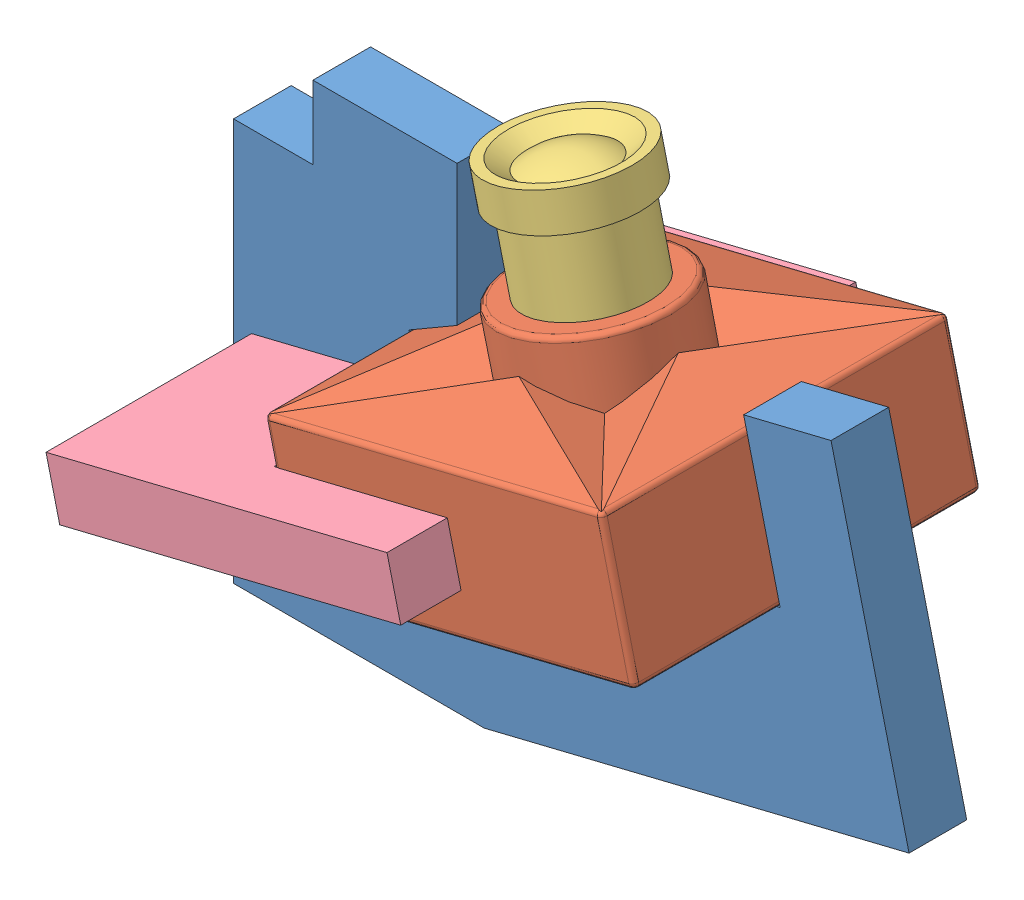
SolidWorks assembly CCD AD1.SLDASM, configuration Default (file format 3100). Lengths in mm.
Overall size (68.45 56.49 47.5).
5 component instances, 4 part files, 5 mates.
Components (placement in the parent):
- CCD camera card AD1-1: CCD camera card AD1.SLDPRT [Default] at (-45.1883 -15.2882 -2.921) size (68.45 48.18 5.84)
- CCD camera-1: CCD camera.SLDASM [Default] at (-15.6733 3.5848 0.0362) x (0.23811 -0.971238 0) z (0 0 1) size (32.86 35.2 35.2)
  - CCD camera base-1: CCD camera base.SLDPRT [Default] at (-14.6184 9.1117 0) size (21.64 35.2 35.2)
  - CCD camera lens-1: CCD camera lens.SLDPRT [Default] at (-28.5037 9.1117 0) x (1 0 0) z (0 0.535089 0.844796) size (20.19 13.97 13.97)
- CCD camera card stabilizer AD1-1: CCD camera card stabilizer AD1.SLDPRT [Default] at (-33.8063 9.8886 0) x (0.971238 0.23811 0) z (0.23811 -0.971238 0) size (35.57 47.5 5.84)
Mates (geometry in assembly coordinates):
- Coincident1: coincident anti-aligned: plane of CCD camera card AD1-1 through (-24.0014 1.8968 2.921) normal (-0.23811 0.971238 0); plane of CCD camera-1/CCD camera base-1 through (-24.0014 1.8968 17.6384) normal (0.23811 -0.971238 0)
- Coincident2: coincident anti-aligned: plane of CCD camera card AD1-1 through (-25.0145 6.029 2.921) normal (0.971238 0.23811 0); plane of CCD camera-1/CCD camera base-1 through (-24.0014 1.8968 17.6384) normal (-0.971238 -0.23811 0)
- Parallel1: parallel anti-aligned: line of CCD camera card AD1-1; line of CCD camera card stabilizer AD1-1
- Coincident4: coincident: moEndPointRef_w of CCD camera card AD1-1; point of CCD camera card stabilizer AD1-1
- Coincident5: coincident aligned: line of CCD camera card AD1-1; line of CCD camera card stabilizer AD1-1
